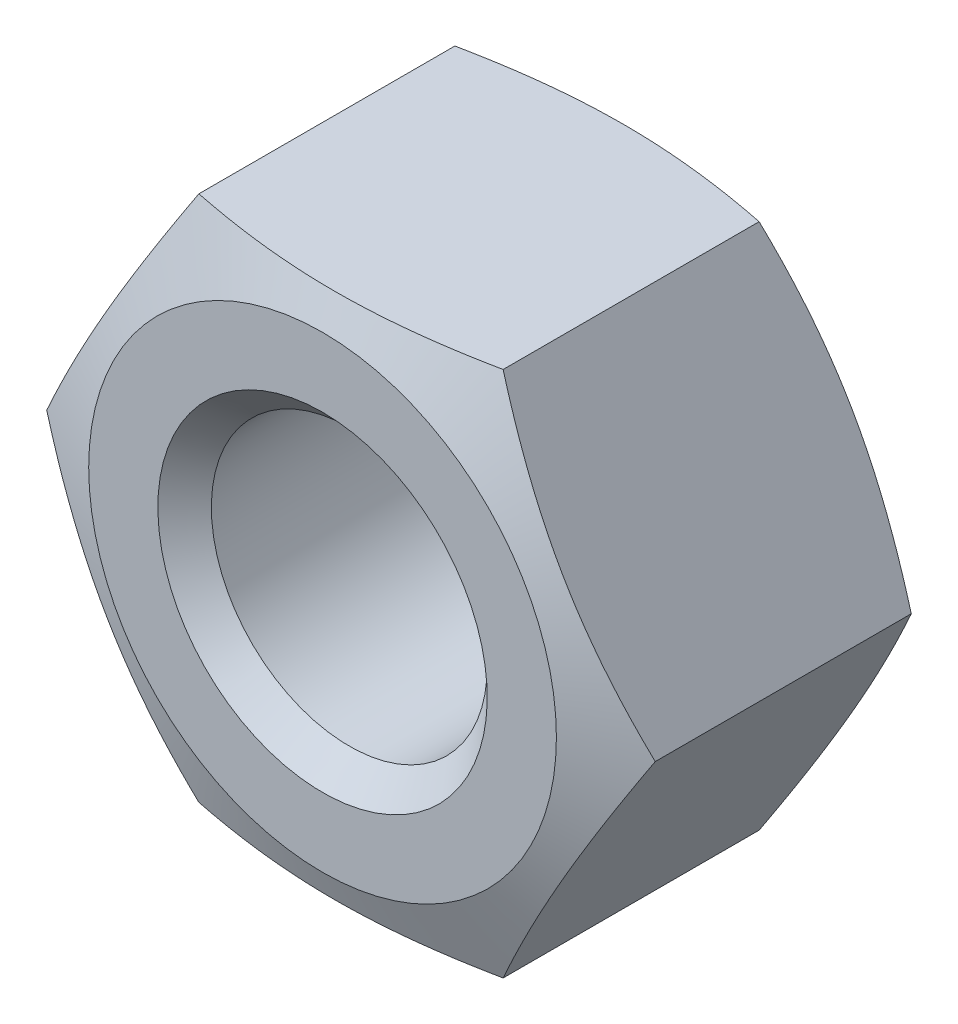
ISO-10303-21;
HEADER;
FILE_DESCRIPTION(('STEP AP214'),'2;1');
FILE_NAME('part.step','',(''),(''),'','','');
FILE_SCHEMA(('AUTOMOTIVE_DESIGN { 1 0 10303 214 1 1 1 1 }'));
ENDSEC;
DATA;
#1=APPLICATION_CONTEXT('core data for automotive mechanical design processes');
#2=APPLICATION_PROTOCOL_DEFINITION('international standard','automotive_design',2000,#1);
#3=PRODUCT_CONTEXT('',#1,'mechanical');
#4=PRODUCT('Part','Part','',(#3));
#5=PRODUCT_RELATED_PRODUCT_CATEGORY('part','',(#4));
#6=PRODUCT_DEFINITION_FORMATION('','',#4);
#7=PRODUCT_DEFINITION_CONTEXT('part definition',#1,'design');
#8=PRODUCT_DEFINITION('design','',#6,#7);
#9=PRODUCT_DEFINITION_SHAPE('','',#8);
#10=(LENGTH_UNIT() NAMED_UNIT(*) SI_UNIT(.MILLI.,.METRE.));
#11=(NAMED_UNIT(*) PLANE_ANGLE_UNIT() SI_UNIT($,.RADIAN.));
#12=(NAMED_UNIT(*) SI_UNIT($,.STERADIAN.) SOLID_ANGLE_UNIT());
#13=UNCERTAINTY_MEASURE_WITH_UNIT(LENGTH_MEASURE(1.E-05),#10,'distance_accuracy_value','');
#14=(GEOMETRIC_REPRESENTATION_CONTEXT(3) GLOBAL_UNCERTAINTY_ASSIGNED_CONTEXT((#13)) GLOBAL_UNIT_ASSIGNED_CONTEXT((#10,
#11,#12)) REPRESENTATION_CONTEXT('',''));
#15=CARTESIAN_POINT('',(0.,0.,0.));
#16=DIRECTION('',(0.,0.,1.));
#17=DIRECTION('',(1.,0.,0.));
#18=AXIS2_PLACEMENT_3D('',#15,#16,#17);
#19=CARTESIAN_POINT('',(9.2376,0.,9.5));
#20=DIRECTION('',(0.,0.,1.));
#21=DIRECTION('',(1.,0.,0.));
#22=AXIS2_PLACEMENT_3D('',#19,#20,#21);
#23=PLANE('',#22);
#24=CARTESIAN_POINT('',(0.,0.,9.5));
#25=DIRECTION('',(0.,0.,-1.));
#26=DIRECTION('',(0.,1.,0.));
#27=AXIS2_PLACEMENT_3D('',#24,#25,#26);
#28=CIRCLE('',#27,5.);
#29=CARTESIAN_POINT('',(0.,5.,9.5));
#30=VERTEX_POINT('',#29);
#31=EDGE_CURVE('E208',#30,#30,#28,.T.);
#32=ORIENTED_EDGE('',*,*,#31,.T.);
#33=EDGE_LOOP('',(#32));
#34=FACE_BOUND('',#33,.T.);
#35=CARTESIAN_POINT('',(0.,0.,9.5));
#36=DIRECTION('',(0.,0.,-1.));
#37=DIRECTION('',(0.,1.,0.));
#38=AXIS2_PLACEMENT_3D('',#35,#36,#37);
#39=CIRCLE('',#38,7.10002499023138);
#40=CARTESIAN_POINT('',(0.,7.10002499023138,9.5));
#41=VERTEX_POINT('',#40);
#42=EDGE_CURVE('E211',#41,#41,#39,.T.);
#43=ORIENTED_EDGE('',*,*,#42,.F.);
#44=EDGE_LOOP('',(#43));
#45=FACE_BOUND('',#44,.T.);
#46=ADVANCED_FACE('F17',(#34,#45),#23,.T.);
#47=CARTESIAN_POINT('',(0.,0.,9.5));
#48=DIRECTION('',(0.,0.,1.));
#49=DIRECTION('',(0.,-1.,0.));
#50=AXIS2_PLACEMENT_3D('',#47,#48,#49);
#51=CONICAL_SURFACE('',#50,5.,0.785398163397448);
#52=CARTESIAN_POINT('',(0.,0.,8.688125));
#53=DIRECTION('',(0.,0.,-1.));
#54=DIRECTION('',(0.,1.,0.));
#55=AXIS2_PLACEMENT_3D('',#52,#53,#54);
#56=CIRCLE('',#55,4.188125);
#57=CARTESIAN_POINT('',(0.,4.188125,8.688125));
#58=VERTEX_POINT('',#57);
#59=EDGE_CURVE('E98',#58,#58,#56,.T.);
#60=ORIENTED_EDGE('',*,*,#59,.T.);
#61=EDGE_LOOP('',(#60));
#62=FACE_BOUND('',#61,.T.);
#63=ORIENTED_EDGE('',*,*,#31,.F.);
#64=EDGE_LOOP('',(#63));
#65=FACE_BOUND('',#64,.T.);
#66=ADVANCED_FACE('F141',(#62,#65),#51,.F.);
#67=CARTESIAN_POINT('',(0.,0.,0.));
#68=DIRECTION('',(0.,0.,-1.));
#69=DIRECTION('',(0.,1.,0.));
#70=AXIS2_PLACEMENT_3D('',#67,#68,#69);
#71=CYLINDRICAL_SURFACE('',#70,4.188125);
#72=CARTESIAN_POINT('',(0.,0.,0.811875));
#73=DIRECTION('',(0.,0.,-1.));
#74=DIRECTION('',(0.,1.,0.));
#75=AXIS2_PLACEMENT_3D('',#72,#73,#74);
#76=CIRCLE('',#75,4.188125);
#77=CARTESIAN_POINT('',(0.,4.188125,0.811875));
#78=VERTEX_POINT('',#77);
#79=EDGE_CURVE('E95',#78,#78,#76,.T.);
#80=ORIENTED_EDGE('',*,*,#79,.T.);
#81=EDGE_LOOP('',(#80));
#82=FACE_BOUND('',#81,.T.);
#83=ORIENTED_EDGE('',*,*,#59,.F.);
#84=EDGE_LOOP('',(#83));
#85=FACE_BOUND('',#84,.T.);
#86=ADVANCED_FACE('F203',(#82,#85),#71,.F.);
#87=CARTESIAN_POINT('',(0.,0.,0.));
#88=DIRECTION('',(0.,0.,-1.));
#89=DIRECTION('',(0.,1.,0.));
#90=AXIS2_PLACEMENT_3D('',#87,#88,#89);
#91=CONICAL_SURFACE('',#90,5.,0.785398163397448);
#92=ORIENTED_EDGE('',*,*,#79,.F.);
#93=EDGE_LOOP('',(#92));
#94=FACE_BOUND('',#93,.T.);
#95=CARTESIAN_POINT('',(0.,0.,0.));
#96=DIRECTION('',(0.,0.,-1.));
#97=DIRECTION('',(0.,1.,0.));
#98=AXIS2_PLACEMENT_3D('',#95,#96,#97);
#99=CIRCLE('',#98,5.);
#100=CARTESIAN_POINT('',(0.,5.,0.));
#101=VERTEX_POINT('',#100);
#102=EDGE_CURVE('E212',#101,#101,#99,.T.);
#103=ORIENTED_EDGE('',*,*,#102,.T.);
#104=EDGE_LOOP('',(#103));
#105=FACE_BOUND('',#104,.T.);
#106=ADVANCED_FACE('F139',(#94,#105),#91,.F.);
#107=CARTESIAN_POINT('',(0.,0.,8.63636363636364));
#108=DIRECTION('',(0.,0.,-1.));
#109=DIRECTION('',(0.,1.,0.));
#110=AXIS2_PLACEMENT_3D('',#107,#108,#109);
#111=CONICAL_SURFACE('',#110,9.2376,1.18682389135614);
#112=ORIENTED_EDGE('',*,*,#42,.T.);
#113=EDGE_LOOP('',(#112));
#114=FACE_BOUND('',#113,.T.);
#115=CARTESIAN_POINT('',(-12.19767328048,-7.99999626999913,6.47502967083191));
#116=CARTESIAN_POINT('',(-11.8369455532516,-7.99999626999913,6.59686503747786));
#117=CARTESIAN_POINT('',(-11.4757372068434,-7.99999626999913,6.7173036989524));
#118=CARTESIAN_POINT('',(-10.7521106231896,-7.99999626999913,6.95460718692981));
#119=CARTESIAN_POINT('',(-10.3896922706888,-7.99999626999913,7.07147166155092));
#120=CARTESIAN_POINT('',(-9.66258724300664,-7.99999626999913,7.30110019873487));
#121=CARTESIAN_POINT('',(-9.29789719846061,-7.99999626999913,7.41385363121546));
#122=CARTESIAN_POINT('',(-8.5668680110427,-7.99999626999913,7.63387021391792));
#123=CARTESIAN_POINT('',(-8.20052890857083,-7.99999626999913,7.74113349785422));
#124=CARTESIAN_POINT('',(-7.4706495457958,-7.99999626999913,7.94744474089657));
#125=CARTESIAN_POINT('',(-7.10713437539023,-7.99999626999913,8.04658101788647));
#126=CARTESIAN_POINT('',(-6.37789114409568,-7.99999626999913,8.23645887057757));
#127=CARTESIAN_POINT('',(-6.01216301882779,-7.99999626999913,8.32720020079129));
#128=CARTESIAN_POINT('',(-5.27844378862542,-7.99999626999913,8.49811523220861));
#129=CARTESIAN_POINT('',(-4.91045408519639,-7.99999626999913,8.5782948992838));
#130=CARTESIAN_POINT('',(-4.17185990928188,-7.99999626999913,8.72560360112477));
#131=CARTESIAN_POINT('',(-3.80125562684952,-7.99999626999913,8.79273357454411));
#132=CARTESIAN_POINT('',(-3.13357726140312,-7.99999626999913,8.89901595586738));
#133=CARTESIAN_POINT('',(-2.83696940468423,-7.99999626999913,8.94108241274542));
#134=CARTESIAN_POINT('',(-2.24234400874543,-7.99999626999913,9.01377227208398));
#135=CARTESIAN_POINT('',(-1.94432650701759,-7.99999626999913,9.04439597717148));
#136=CARTESIAN_POINT('',(-1.34744167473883,-7.99999626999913,9.0929877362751));
#137=CARTESIAN_POINT('',(-1.04857501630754,-7.99999626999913,9.11096394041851));
#138=CARTESIAN_POINT('',(-0.450331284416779,-7.99999626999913,9.13350733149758));
#139=CARTESIAN_POINT('',(-0.15095421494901,-7.99999626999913,9.13807462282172));
#140=CARTESIAN_POINT('',(0.449149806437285,-7.99999626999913,9.13357880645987));
#141=CARTESIAN_POINT('',(0.749876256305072,-7.99999626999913,9.12444942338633));
#142=CARTESIAN_POINT('',(1.35062263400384,-7.99999626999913,9.09285820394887));
#143=CARTESIAN_POINT('',(1.65064255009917,-7.99999626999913,9.07039614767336));
#144=CARTESIAN_POINT('',(2.2496744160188,-7.99999626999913,9.01308145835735));
#145=CARTESIAN_POINT('',(2.54868560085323,-7.99999626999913,8.97822093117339));
#146=CARTESIAN_POINT('',(3.14518812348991,-7.99999626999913,8.89742198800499));
#147=CARTESIAN_POINT('',(3.44267946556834,-7.99999626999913,8.85148360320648));
#148=CARTESIAN_POINT('',(4.08581977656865,-7.99999626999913,8.74145581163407));
#149=CARTESIAN_POINT('',(4.43116695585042,-7.99999626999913,8.67561381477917));
#150=CARTESIAN_POINT('',(5.11962527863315,-7.99999626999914,8.53304691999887));
#151=CARTESIAN_POINT('',(5.46273614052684,-7.99999626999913,8.45632067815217));
#152=CARTESIAN_POINT('',(6.14700710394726,-7.99999626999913,8.29395809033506));
#153=CARTESIAN_POINT('',(6.48816615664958,-7.99999626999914,8.20831735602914));
#154=CARTESIAN_POINT('',(7.16857354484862,-7.99999626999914,8.029846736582));
#155=CARTESIAN_POINT('',(7.50782195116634,-7.99999626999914,7.9370171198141));
#156=CARTESIAN_POINT('',(8.18555195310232,-7.99999626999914,7.74528391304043));
#157=CARTESIAN_POINT('',(8.52402920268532,-7.99999626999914,7.64636502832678));
#158=CARTESIAN_POINT('',(9.19955569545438,-7.99999626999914,7.44377413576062));
#159=CARTESIAN_POINT('',(9.53660492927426,-7.99999626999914,7.34010209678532));
#160=CARTESIAN_POINT('',(10.2093892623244,-7.99999626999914,7.12890845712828));
#161=CARTESIAN_POINT('',(10.5451247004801,-7.99999626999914,7.02138793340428));
#162=CARTESIAN_POINT('',(11.2155576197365,-7.99999626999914,6.80315386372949));
#163=CARTESIAN_POINT('',(11.5502550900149,-7.99999626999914,6.69244028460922));
#164=CARTESIAN_POINT('',(12.5484639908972,-7.99999626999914,6.35788971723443));
#165=CARTESIAN_POINT('',(13.210678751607,-7.99999626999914,6.13018509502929));
#166=CARTESIAN_POINT('',(14.532604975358,-7.99999626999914,5.66750667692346));
#167=CARTESIAN_POINT('',(15.1923162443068,-7.99999626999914,5.43253232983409));
#168=CARTESIAN_POINT('',(16.5054811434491,-7.99999626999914,4.95888361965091));
#169=CARTESIAN_POINT('',(17.1589473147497,-7.99999626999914,4.72024397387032));
#170=CARTESIAN_POINT('',(18.1380301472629,-7.99999626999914,4.35939073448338));
#171=CARTESIAN_POINT('',(18.4641845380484,-7.99999626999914,4.23863171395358));
#172=CARTESIAN_POINT('',(19.1161754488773,-7.99999626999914,3.99626205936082));
#173=CARTESIAN_POINT('',(19.4420119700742,-7.99999626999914,3.87465142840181));
#174=CARTESIAN_POINT('',(19.7677109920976,-7.99999626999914,3.75267343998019));
#175=B_SPLINE_CURVE_WITH_KNOTS('',3,(#115,#116,#117,#118,#119,#120,#121,#122,#123,#124,#125,
#126,#127,#128,#129,#130,#131,#132,#133,#134,#135,#136,#137,#138,#139,#140,#141,#142,#143,#144,
#145,#146,#147,#148,#149,#150,#151,#152,#153,#154,#155,#156,#157,#158,#159,#160,#161,#162,#163,
#164,#165,#166,#167,#168,#169,#170,#171,#172,#173,#174),.UNSPECIFIED.,.F.,.F.,(4,2,2,2,2,2,2,2,
2,2,2,2,2,2,2,2,2,2,2,2,2,2,2,2,2,2,2,2,2,4),(0.,1.14225103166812,2.28461415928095,
3.42974735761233,4.57485265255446,5.70514615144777,6.83547269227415,7.96515799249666,
9.09476200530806,9.99329850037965,10.8918112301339,11.7897444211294,12.6876706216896,
13.5899557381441,14.4922557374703,15.3951312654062,16.298004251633,17.3524879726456,
18.4071020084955,19.4622376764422,20.5173339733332,21.5751980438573,22.6330690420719,
23.6906462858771,24.7482345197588,26.8489740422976,28.9498732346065,31.0368874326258,
32.0802632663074,33.1236352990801),.UNSPECIFIED.);
#176=CARTESIAN_POINT('',(-4.6188,-7.99999626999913,8.63636363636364));
#177=VERTEX_POINT('',#176);
#178=CARTESIAN_POINT('',(4.6188,-7.99999626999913,8.63636363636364));
#179=VERTEX_POINT('',#178);
#180=EDGE_CURVE('E78',#177,#179,#175,.T.);
#181=ORIENTED_EDGE('',*,*,#180,.T.);
#182=CARTESIAN_POINT('',(4.61879988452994,-7.99999646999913,8.63636358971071));
#183=CARTESIAN_POINT('',(4.78016828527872,-7.72049820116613,8.70156440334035));
#184=CARTESIAN_POINT('',(4.94206929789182,-7.44007742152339,8.76185304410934));
#185=CARTESIAN_POINT('',(5.26694187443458,-6.87738161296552,8.87075300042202));
#186=CARTESIAN_POINT('',(5.42991400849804,-6.59510559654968,8.91935747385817));
#187=CARTESIAN_POINT('',(5.75669685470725,-6.02910110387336,9.00294310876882));
#188=CARTESIAN_POINT('',(5.92050730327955,-5.7453730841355,9.03792831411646));
#189=CARTESIAN_POINT('',(6.24873668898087,-5.17686311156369,9.09265414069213));
#190=CARTESIAN_POINT('',(6.4131554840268,-4.89208140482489,9.11239812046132));
#191=CARTESIAN_POINT('',(6.73949003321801,-4.32685338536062,9.13541369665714));
#192=CARTESIAN_POINT('',(6.9014008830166,-4.04641556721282,9.13895930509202));
#193=CARTESIAN_POINT('',(7.22512690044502,-3.48570565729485,9.13013256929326));
#194=CARTESIAN_POINT('',(7.38694205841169,-3.20543358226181,9.11775882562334));
#195=CARTESIAN_POINT('',(7.70998795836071,-2.64590167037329,9.0777585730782));
#196=CARTESIAN_POINT('',(7.87121900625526,-2.36664130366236,9.05014175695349));
#197=CARTESIAN_POINT('',(8.19291130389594,-1.80945389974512,8.9809937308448));
#198=CARTESIAN_POINT('',(8.35337262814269,-1.53152673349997,8.93946389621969));
#199=CARTESIAN_POINT('',(8.57389118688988,-1.14957738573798,8.87381724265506));
#200=CARTESIAN_POINT('',(8.63435021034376,-1.04485928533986,8.85492627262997));
#201=CARTESIAN_POINT('',(8.75512556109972,-0.835670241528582,8.81549930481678));
#202=CARTESIAN_POINT('',(8.81544190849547,-0.73119926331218,8.79496355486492));
#203=CARTESIAN_POINT('',(8.93614338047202,-0.522138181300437,8.75226892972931));
#204=CARTESIAN_POINT('',(8.9965280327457,-0.417548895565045,8.73010473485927));
#205=CARTESIAN_POINT('',(9.11716503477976,-0.20859947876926,8.68430965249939));
#206=CARTESIAN_POINT('',(9.17741736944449,-0.104239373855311,8.66067860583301));
#207=CARTESIAN_POINT('',(9.23760011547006,2.00000000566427E-07,8.63636358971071));
#208=B_SPLINE_CURVE_WITH_KNOTS('',3,(#182,#183,#184,#185,#186,#187,#188,#189,#190,#191,#192,
#193,#194,#195,#196,#197,#198,#199,#200,#201,#202,#203,#204,#205,#206,#207),.UNSPECIFIED.,.F.,
.F.,(4,2,2,2,2,2,2,2,2,2,2,2,4),(0.,0.987840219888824,1.97625750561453,2.96438108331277,
3.95228685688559,4.92341776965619,5.89463405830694,6.86523348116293,7.83573698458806,
8.20288448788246,8.56997677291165,8.93832669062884,9.30671665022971),.UNSPECIFIED.);
#209=CARTESIAN_POINT('',(9.2376,0.,8.63636363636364));
#210=VERTEX_POINT('',#209);
#211=EDGE_CURVE('E163',#179,#210,#208,.T.);
#212=ORIENTED_EDGE('',*,*,#211,.T.);
#213=CARTESIAN_POINT('',(9.23760011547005,-1.99999999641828E-07,8.63636358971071));
#214=CARTESIAN_POINT('',(9.07623171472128,0.279498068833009,8.70156440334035));
#215=CARTESIAN_POINT('',(8.91433070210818,0.559918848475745,8.76185304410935));
#216=CARTESIAN_POINT('',(8.58945812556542,1.12261465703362,8.87075300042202));
#217=CARTESIAN_POINT('',(8.42648599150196,1.40489067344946,8.91935747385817));
#218=CARTESIAN_POINT('',(8.09970314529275,1.97089516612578,9.00294310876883));
#219=CARTESIAN_POINT('',(7.93589269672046,2.25462318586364,9.03792831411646));
#220=CARTESIAN_POINT('',(7.60766331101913,2.82313315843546,9.09265414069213));
#221=CARTESIAN_POINT('',(7.44324451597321,3.10791486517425,9.11239812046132));
#222=CARTESIAN_POINT('',(7.11690996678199,3.67314288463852,9.13541369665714));
#223=CARTESIAN_POINT('',(6.95499911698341,3.95358070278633,9.13895930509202));
#224=CARTESIAN_POINT('',(6.63127309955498,4.51429061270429,9.13013256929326));
#225=CARTESIAN_POINT('',(6.46945794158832,4.79456268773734,9.11775882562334));
#226=CARTESIAN_POINT('',(6.14641204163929,5.35409459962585,9.07775857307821));
#227=CARTESIAN_POINT('',(5.98518099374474,5.63335496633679,9.05014175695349));
#228=CARTESIAN_POINT('',(5.66348869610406,6.19054237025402,8.9809937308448));
#229=CARTESIAN_POINT('',(5.50302737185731,6.46846953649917,8.93946389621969));
#230=CARTESIAN_POINT('',(5.28250881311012,6.85041888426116,8.87381724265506));
#231=CARTESIAN_POINT('',(5.22204978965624,6.95513698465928,8.85492627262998));
#232=CARTESIAN_POINT('',(5.10127443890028,7.16432602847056,8.81549930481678));
#233=CARTESIAN_POINT('',(5.04095809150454,7.26879700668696,8.79496355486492));
#234=CARTESIAN_POINT('',(4.92025661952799,7.4778580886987,8.75226892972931));
#235=CARTESIAN_POINT('',(4.85987196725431,7.58244737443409,8.73010473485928));
#236=CARTESIAN_POINT('',(4.73923496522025,7.79139679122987,8.68430965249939));
#237=CARTESIAN_POINT('',(4.67898263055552,7.89575689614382,8.66067860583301));
#238=CARTESIAN_POINT('',(4.61879988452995,7.99999646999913,8.63636358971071));
#239=B_SPLINE_CURVE_WITH_KNOTS('',3,(#213,#214,#215,#216,#217,#218,#219,#220,#221,#222,#223,
#224,#225,#226,#227,#228,#229,#230,#231,#232,#233,#234,#235,#236,#237,#238),.UNSPECIFIED.,.F.,
.F.,(4,2,2,2,2,2,2,2,2,2,2,2,4),(0.,0.987840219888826,1.97625750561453,2.96438108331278,
3.95228685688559,4.92341776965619,5.89463405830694,6.86523348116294,7.83573698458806,
8.20288448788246,8.56997677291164,8.93832669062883,9.30671665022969),.UNSPECIFIED.);
#240=CARTESIAN_POINT('',(4.6188,7.99999626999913,8.63636363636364));
#241=VERTEX_POINT('',#240);
#242=EDGE_CURVE('E40',#210,#241,#239,.T.);
#243=ORIENTED_EDGE('',*,*,#242,.T.);
#244=CARTESIAN_POINT('',(-12.19767328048,7.99999626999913,6.47502967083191));
#245=CARTESIAN_POINT('',(-11.8369455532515,7.99999626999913,6.59686503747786));
#246=CARTESIAN_POINT('',(-11.4757372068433,7.99999626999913,6.7173036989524));
#247=CARTESIAN_POINT('',(-10.7521106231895,7.99999626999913,6.95460718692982));
#248=CARTESIAN_POINT('',(-10.3896922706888,7.99999626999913,7.07147166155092));
#249=CARTESIAN_POINT('',(-9.66258724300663,7.99999626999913,7.30110019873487));
#250=CARTESIAN_POINT('',(-9.29789719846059,7.99999626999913,7.41385363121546));
#251=CARTESIAN_POINT('',(-8.56686801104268,7.99999626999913,7.63387021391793));
#252=CARTESIAN_POINT('',(-8.20052890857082,7.99999626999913,7.74113349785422));
#253=CARTESIAN_POINT('',(-7.47064954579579,7.99999626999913,7.94744474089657));
#254=CARTESIAN_POINT('',(-7.10713437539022,7.99999626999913,8.04658101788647));
#255=CARTESIAN_POINT('',(-6.37789114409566,7.99999626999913,8.23645887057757));
#256=CARTESIAN_POINT('',(-6.01216301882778,7.99999626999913,8.32720020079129));
#257=CARTESIAN_POINT('',(-5.27844378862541,7.99999626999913,8.49811523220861));
#258=CARTESIAN_POINT('',(-4.91045408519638,7.99999626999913,8.5782948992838));
#259=CARTESIAN_POINT('',(-4.17185990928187,7.99999626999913,8.72560360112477));
#260=CARTESIAN_POINT('',(-3.80125562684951,7.99999626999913,8.79273357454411));
#261=CARTESIAN_POINT('',(-3.13357726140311,7.99999626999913,8.89901595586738));
#262=CARTESIAN_POINT('',(-2.83696940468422,7.99999626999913,8.94108241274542));
#263=CARTESIAN_POINT('',(-2.24234400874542,7.99999626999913,9.01377227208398));
#264=CARTESIAN_POINT('',(-1.94432650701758,7.99999626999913,9.04439597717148));
#265=CARTESIAN_POINT('',(-1.34744167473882,7.99999626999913,9.0929877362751));
#266=CARTESIAN_POINT('',(-1.04857501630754,7.99999626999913,9.11096394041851));
#267=CARTESIAN_POINT('',(-0.450331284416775,7.99999626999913,9.13350733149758));
#268=CARTESIAN_POINT('',(-0.150954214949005,7.99999626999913,9.13807462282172));
#269=CARTESIAN_POINT('',(0.44914980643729,7.99999626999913,9.13357880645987));
#270=CARTESIAN_POINT('',(0.749876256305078,7.99999626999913,9.12444942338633));
#271=CARTESIAN_POINT('',(1.35062263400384,7.99999626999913,9.09285820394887));
#272=CARTESIAN_POINT('',(1.65064255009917,7.99999626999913,9.07039614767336));
#273=CARTESIAN_POINT('',(2.2496744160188,7.99999626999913,9.01308145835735));
#274=CARTESIAN_POINT('',(2.54868560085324,7.99999626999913,8.97822093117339));
#275=CARTESIAN_POINT('',(3.14518812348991,7.99999626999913,8.89742198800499));
#276=CARTESIAN_POINT('',(3.44267946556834,7.99999626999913,8.85148360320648));
#277=CARTESIAN_POINT('',(4.08581977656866,7.99999626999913,8.74145581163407));
#278=CARTESIAN_POINT('',(4.43116695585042,7.99999626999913,8.67561381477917));
#279=CARTESIAN_POINT('',(5.11962527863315,7.99999626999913,8.53304691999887));
#280=CARTESIAN_POINT('',(5.46273614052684,7.99999626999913,8.45632067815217));
#281=CARTESIAN_POINT('',(6.14700710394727,7.99999626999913,8.29395809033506));
#282=CARTESIAN_POINT('',(6.48816615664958,7.99999626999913,8.20831735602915));
#283=CARTESIAN_POINT('',(7.16857354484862,7.99999626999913,8.029846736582));
#284=CARTESIAN_POINT('',(7.50782195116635,7.99999626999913,7.9370171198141));
#285=CARTESIAN_POINT('',(8.18555195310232,7.99999626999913,7.74528391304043));
#286=CARTESIAN_POINT('',(8.52402920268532,7.99999626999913,7.64636502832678));
#287=CARTESIAN_POINT('',(9.19955569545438,7.99999626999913,7.44377413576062));
#288=CARTESIAN_POINT('',(9.53660492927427,7.99999626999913,7.34010209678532));
#289=CARTESIAN_POINT('',(10.2093892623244,7.99999626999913,7.12890845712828));
#290=CARTESIAN_POINT('',(10.5451247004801,7.99999626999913,7.02138793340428));
#291=CARTESIAN_POINT('',(11.2155576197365,7.99999626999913,6.80315386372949));
#292=CARTESIAN_POINT('',(11.5502550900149,7.99999626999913,6.69244028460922));
#293=CARTESIAN_POINT('',(12.5484639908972,7.99999626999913,6.35788971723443));
#294=CARTESIAN_POINT('',(13.210678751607,7.99999626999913,6.13018509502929));
#295=CARTESIAN_POINT('',(14.532604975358,7.99999626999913,5.66750667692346));
#296=CARTESIAN_POINT('',(15.1923162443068,7.99999626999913,5.43253232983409));
#297=CARTESIAN_POINT('',(16.5054811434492,7.99999626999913,4.95888361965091));
#298=CARTESIAN_POINT('',(17.1589473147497,7.99999626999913,4.72024397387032));
#299=CARTESIAN_POINT('',(18.1380301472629,7.99999626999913,4.35939073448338));
#300=CARTESIAN_POINT('',(18.4641845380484,7.99999626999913,4.23863171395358));
#301=CARTESIAN_POINT('',(19.1161754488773,7.99999626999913,3.99626205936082));
#302=CARTESIAN_POINT('',(19.4420119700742,7.99999626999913,3.87465142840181));
#303=CARTESIAN_POINT('',(19.7677109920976,7.99999626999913,3.75267343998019));
#304=B_SPLINE_CURVE_WITH_KNOTS('',3,(#244,#245,#246,#247,#248,#249,#250,#251,#252,#253,#254,
#255,#256,#257,#258,#259,#260,#261,#262,#263,#264,#265,#266,#267,#268,#269,#270,#271,#272,#273,
#274,#275,#276,#277,#278,#279,#280,#281,#282,#283,#284,#285,#286,#287,#288,#289,#290,#291,#292,
#293,#294,#295,#296,#297,#298,#299,#300,#301,#302,#303),.UNSPECIFIED.,.F.,.F.,(4,2,2,2,2,2,2,2,
2,2,2,2,2,2,2,2,2,2,2,2,2,2,2,2,2,2,2,2,2,4),(0.,1.14225103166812,2.28461415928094,
3.42974735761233,4.57485265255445,5.70514615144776,6.83547269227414,7.96515799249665,
9.09476200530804,9.99329850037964,10.8918112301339,11.7897444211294,12.6876706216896,
13.5899557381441,14.4922557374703,15.3951312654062,16.298004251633,17.3524879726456,
18.4071020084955,19.4622376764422,20.5173339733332,21.5751980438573,22.6330690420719,
23.6906462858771,24.7482345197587,26.8489740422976,28.9498732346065,31.0368874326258,
32.0802632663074,33.1236352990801),.UNSPECIFIED.);
#305=CARTESIAN_POINT('',(-4.6188,7.99999626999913,8.63636363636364));
#306=VERTEX_POINT('',#305);
#307=EDGE_CURVE('E154',#241,#306,#304,.F.);
#308=ORIENTED_EDGE('',*,*,#307,.T.);
#309=CARTESIAN_POINT('',(-4.61879988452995,7.99999646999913,8.63636358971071));
#310=CARTESIAN_POINT('',(-4.78016828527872,7.72049820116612,8.70156440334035));
#311=CARTESIAN_POINT('',(-4.94206929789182,7.44007742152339,8.76185304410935));
#312=CARTESIAN_POINT('',(-5.26694187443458,6.87738161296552,8.87075300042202));
#313=CARTESIAN_POINT('',(-5.42991400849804,6.59510559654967,8.91935747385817));
#314=CARTESIAN_POINT('',(-5.75669685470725,6.02910110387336,9.00294310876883));
#315=CARTESIAN_POINT('',(-5.92050730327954,5.74537308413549,9.03792831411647));
#316=CARTESIAN_POINT('',(-6.24873668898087,5.17686311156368,9.09265414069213));
#317=CARTESIAN_POINT('',(-6.41315548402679,4.89208140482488,9.11239812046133));
#318=CARTESIAN_POINT('',(-6.739490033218,4.32685338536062,9.13541369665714));
#319=CARTESIAN_POINT('',(-6.90140088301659,4.04641556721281,9.13895930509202));
#320=CARTESIAN_POINT('',(-7.22512690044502,3.48570565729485,9.13013256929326));
#321=CARTESIAN_POINT('',(-7.38694205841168,3.2054335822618,9.11775882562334));
#322=CARTESIAN_POINT('',(-7.7099879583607,2.64590167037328,9.07775857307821));
#323=CARTESIAN_POINT('',(-7.87121900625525,2.36664130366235,9.0501417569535));
#324=CARTESIAN_POINT('',(-8.19291130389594,1.80945389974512,8.9809937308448));
#325=CARTESIAN_POINT('',(-8.35337262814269,1.53152673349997,8.93946389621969));
#326=CARTESIAN_POINT('',(-8.57389118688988,1.14957738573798,8.87381724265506));
#327=CARTESIAN_POINT('',(-8.63435021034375,1.04485928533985,8.85492627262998));
#328=CARTESIAN_POINT('',(-8.75512556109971,0.835670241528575,8.81549930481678));
#329=CARTESIAN_POINT('',(-8.81544190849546,0.731199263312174,8.79496355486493));
#330=CARTESIAN_POINT('',(-8.93614338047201,0.522138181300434,8.75226892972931));
#331=CARTESIAN_POINT('',(-8.99652803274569,0.417548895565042,8.73010473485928));
#332=CARTESIAN_POINT('',(-9.11716503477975,0.208599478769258,8.68430965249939));
#333=CARTESIAN_POINT('',(-9.17741736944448,0.104239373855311,8.66067860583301));
#334=CARTESIAN_POINT('',(-9.23760011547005,-1.99999998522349E-07,8.63636358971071));
#335=B_SPLINE_CURVE_WITH_KNOTS('',3,(#309,#310,#311,#312,#313,#314,#315,#316,#317,#318,#319,
#320,#321,#322,#323,#324,#325,#326,#327,#328,#329,#330,#331,#332,#333,#334),.UNSPECIFIED.,.F.,
.F.,(4,2,2,2,2,2,2,2,2,2,2,2,4),(0.,0.987840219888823,1.97625750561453,2.96438108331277,
3.95228685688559,4.92341776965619,5.89463405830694,6.86523348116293,7.83573698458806,
8.20288448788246,8.56997677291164,8.93832669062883,9.3067166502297),.UNSPECIFIED.);
#336=CARTESIAN_POINT('',(-9.2376,0.,8.63636363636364));
#337=VERTEX_POINT('',#336);
#338=EDGE_CURVE('E149',#306,#337,#335,.T.);
#339=ORIENTED_EDGE('',*,*,#338,.T.);
#340=CARTESIAN_POINT('',(-9.23760011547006,2.00000001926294E-07,8.63636358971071));
#341=CARTESIAN_POINT('',(-9.07623171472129,-0.279498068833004,8.70156440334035));
#342=CARTESIAN_POINT('',(-8.91433070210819,-0.559918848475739,8.76185304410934));
#343=CARTESIAN_POINT('',(-8.58945812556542,-1.12261465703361,8.87075300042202));
#344=CARTESIAN_POINT('',(-8.42648599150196,-1.40489067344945,8.91935747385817));
#345=CARTESIAN_POINT('',(-8.09970314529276,-1.97089516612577,9.00294310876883));
#346=CARTESIAN_POINT('',(-7.93589269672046,-2.25462318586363,9.03792831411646));
#347=CARTESIAN_POINT('',(-7.60766331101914,-2.82313315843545,9.09265414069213));
#348=CARTESIAN_POINT('',(-7.44324451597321,-3.10791486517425,9.11239812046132));
#349=CARTESIAN_POINT('',(-7.116909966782,-3.67314288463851,9.13541369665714));
#350=CARTESIAN_POINT('',(-6.95499911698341,-3.95358070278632,9.13895930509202));
#351=CARTESIAN_POINT('',(-6.63127309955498,-4.51429061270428,9.13013256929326));
#352=CARTESIAN_POINT('',(-6.46945794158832,-4.79456268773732,9.11775882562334));
#353=CARTESIAN_POINT('',(-6.1464120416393,-5.35409459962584,9.07775857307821));
#354=CARTESIAN_POINT('',(-5.98518099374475,-5.63335496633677,9.0501417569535));
#355=CARTESIAN_POINT('',(-5.66348869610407,-6.19054237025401,8.9809937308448));
#356=CARTESIAN_POINT('',(-5.50302737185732,-6.46846953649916,8.93946389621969));
#357=CARTESIAN_POINT('',(-5.28250881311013,-6.85041888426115,8.87381724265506));
#358=CARTESIAN_POINT('',(-5.22204978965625,-6.95513698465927,8.85492627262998));
#359=CARTESIAN_POINT('',(-5.10127443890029,-7.16432602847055,8.81549930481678));
#360=CARTESIAN_POINT('',(-5.04095809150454,-7.26879700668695,8.79496355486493));
#361=CARTESIAN_POINT('',(-4.92025661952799,-7.47785808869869,8.75226892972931));
#362=CARTESIAN_POINT('',(-4.85987196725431,-7.58244737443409,8.73010473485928));
#363=CARTESIAN_POINT('',(-4.73923496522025,-7.79139679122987,8.68430965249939));
#364=CARTESIAN_POINT('',(-4.67898263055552,-7.89575689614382,8.66067860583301));
#365=CARTESIAN_POINT('',(-4.61879988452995,-7.99999646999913,8.63636358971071));
#366=B_SPLINE_CURVE_WITH_KNOTS('',3,(#340,#341,#342,#343,#344,#345,#346,#347,#348,#349,#350,
#351,#352,#353,#354,#355,#356,#357,#358,#359,#360,#361,#362,#363,#364,#365),.UNSPECIFIED.,.F.,
.F.,(4,2,2,2,2,2,2,2,2,2,2,2,4),(0.,0.987840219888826,1.97625750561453,2.96438108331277,
3.95228685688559,4.92341776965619,5.89463405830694,6.86523348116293,7.83573698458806,
8.20288448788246,8.56997677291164,8.93832669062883,9.3067166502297),.UNSPECIFIED.);
#367=EDGE_CURVE('E126',#337,#177,#366,.T.);
#368=ORIENTED_EDGE('',*,*,#367,.T.);
#369=EDGE_LOOP('',(#181,#212,#243,#308,#339,#368));
#370=FACE_BOUND('',#369,.T.);
#371=ADVANCED_FACE('F135',(#114,#370),#111,.T.);
#372=CARTESIAN_POINT('',(4.6188,-7.99999626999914,9.5));
#373=DIRECTION('',(-0.866025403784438,0.5,0.));
#374=DIRECTION('',(-0.5,-0.866025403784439,0.));
#375=AXIS2_PLACEMENT_3D('',#372,#373,#374);
#376=PLANE('',#375);
#377=ORIENTED_EDGE('',*,*,#211,.F.);
#378=DIRECTION('',(0.,0.,-1.));
#379=VECTOR('',#378,1.);
#380=CARTESIAN_POINT('',(4.6188,-7.99999626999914,9.5));
#381=LINE('',#380,#379);
#382=CARTESIAN_POINT('',(4.6188,-7.99999626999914,0.863636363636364));
#383=VERTEX_POINT('',#382);
#384=EDGE_CURVE('E82',#179,#383,#381,.T.);
#385=ORIENTED_EDGE('',*,*,#384,.T.);
#386=CARTESIAN_POINT('',(9.23760011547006,2.00000000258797E-07,0.863636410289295));
#387=CARTESIAN_POINT('',(9.07623171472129,-0.279498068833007,0.798435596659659));
#388=CARTESIAN_POINT('',(8.91433070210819,-0.559918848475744,0.738146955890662));
#389=CARTESIAN_POINT('',(8.58945812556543,-1.12261465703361,0.629246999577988));
#390=CARTESIAN_POINT('',(8.42648599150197,-1.40489067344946,0.580642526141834));
#391=CARTESIAN_POINT('',(8.09970314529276,-1.97089516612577,0.497056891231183));
#392=CARTESIAN_POINT('',(7.93589269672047,-2.25462318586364,0.462071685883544));
#393=CARTESIAN_POINT('',(7.60766331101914,-2.82313315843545,0.407345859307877));
#394=CARTESIAN_POINT('',(7.44324451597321,-3.10791486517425,0.387601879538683));
#395=CARTESIAN_POINT('',(7.116909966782,-3.67314288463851,0.364586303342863));
#396=CARTESIAN_POINT('',(6.95499911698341,-3.95358070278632,0.361040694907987));
#397=CARTESIAN_POINT('',(6.63127309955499,-4.51429061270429,0.369867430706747));
#398=CARTESIAN_POINT('',(6.46945794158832,-4.79456268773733,0.382241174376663));
#399=CARTESIAN_POINT('',(6.1464120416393,-5.35409459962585,0.422241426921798));
#400=CARTESIAN_POINT('',(5.98518099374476,-5.63335496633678,0.44985824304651));
#401=CARTESIAN_POINT('',(5.66348869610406,-6.19054237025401,0.519006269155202));
#402=CARTESIAN_POINT('',(5.5030273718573,-6.46846953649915,0.560536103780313));
#403=CARTESIAN_POINT('',(5.28250881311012,-6.85041888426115,0.626182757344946));
#404=CARTESIAN_POINT('',(5.22204978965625,-6.95513698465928,0.645073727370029));
#405=CARTESIAN_POINT('',(5.10127443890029,-7.16432602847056,0.684500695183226));
#406=CARTESIAN_POINT('',(5.04095809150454,-7.26879700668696,0.705036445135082));
#407=CARTESIAN_POINT('',(4.92025661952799,-7.4778580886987,0.747731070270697));
#408=CARTESIAN_POINT('',(4.85987196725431,-7.5824473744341,0.769895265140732));
#409=CARTESIAN_POINT('',(4.73923496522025,-7.79139679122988,0.815690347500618));
#410=CARTESIAN_POINT('',(4.67898263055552,-7.89575689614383,0.839321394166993));
#411=CARTESIAN_POINT('',(4.61879988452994,-7.99999646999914,0.863636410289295));
#412=B_SPLINE_CURVE_WITH_KNOTS('',3,(#386,#387,#388,#389,#390,#391,#392,#393,#394,#395,#396,
#397,#398,#399,#400,#401,#402,#403,#404,#405,#406,#407,#408,#409,#410,#411),.UNSPECIFIED.,.F.,
.F.,(4,2,2,2,2,2,2,2,2,2,2,2,4),(0.,0.987840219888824,1.97625750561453,2.96438108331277,
3.95228685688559,4.92341776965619,5.89463405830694,6.86523348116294,7.83573698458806,
8.20288448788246,8.56997677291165,8.93832669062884,9.30671665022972),.UNSPECIFIED.);
#413=CARTESIAN_POINT('',(9.2376,0.,0.863636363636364));
#414=VERTEX_POINT('',#413);
#415=EDGE_CURVE('E33',#414,#383,#412,.T.);
#416=ORIENTED_EDGE('',*,*,#415,.F.);
#417=DIRECTION('',(0.,0.,-1.));
#418=VECTOR('',#417,1.);
#419=CARTESIAN_POINT('',(9.2376,0.,9.5));
#420=LINE('',#419,#418);
#421=EDGE_CURVE('E26',#210,#414,#420,.T.);
#422=ORIENTED_EDGE('',*,*,#421,.F.);
#423=EDGE_LOOP('',(#377,#385,#416,#422));
#424=FACE_BOUND('',#423,.T.);
#425=ADVANCED_FACE('F19',(#424),#376,.F.);
#426=CARTESIAN_POINT('',(9.2376,0.,9.5));
#427=DIRECTION('',(-0.866025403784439,-0.5,0.));
#428=DIRECTION('',(0.5,-0.866025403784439,0.));
#429=AXIS2_PLACEMENT_3D('',#426,#427,#428);
#430=PLANE('',#429);
#431=ORIENTED_EDGE('',*,*,#242,.F.);
#432=ORIENTED_EDGE('',*,*,#421,.T.);
#433=CARTESIAN_POINT('',(4.61879988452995,7.99999646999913,0.863636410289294));
#434=CARTESIAN_POINT('',(4.78016828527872,7.72049820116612,0.798435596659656));
#435=CARTESIAN_POINT('',(4.94206929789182,7.44007742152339,0.738146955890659));
#436=CARTESIAN_POINT('',(5.26694187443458,6.87738161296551,0.629246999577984));
#437=CARTESIAN_POINT('',(5.42991400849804,6.59510559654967,0.58064252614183));
#438=CARTESIAN_POINT('',(5.75669685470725,6.02910110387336,0.497056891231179));
#439=CARTESIAN_POINT('',(5.92050730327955,5.74537308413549,0.46207168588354));
#440=CARTESIAN_POINT('',(6.24873668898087,5.17686311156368,0.407345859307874));
#441=CARTESIAN_POINT('',(6.41315548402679,4.89208140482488,0.38760187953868));
#442=CARTESIAN_POINT('',(6.739490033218,4.32685338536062,0.364586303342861));
#443=CARTESIAN_POINT('',(6.90140088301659,4.04641556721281,0.361040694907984));
#444=CARTESIAN_POINT('',(7.22512690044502,3.48570565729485,0.369867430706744));
#445=CARTESIAN_POINT('',(7.38694205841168,3.2054335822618,0.382241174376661));
#446=CARTESIAN_POINT('',(7.7099879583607,2.64590167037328,0.422241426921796));
#447=CARTESIAN_POINT('',(7.87121900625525,2.36664130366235,0.449858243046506));
#448=CARTESIAN_POINT('',(8.19291130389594,1.80945389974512,0.519006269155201));
#449=CARTESIAN_POINT('',(8.35337262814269,1.53152673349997,0.560536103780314));
#450=CARTESIAN_POINT('',(8.57389118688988,1.14957738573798,0.626182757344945));
#451=CARTESIAN_POINT('',(8.63435021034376,1.04485928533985,0.645073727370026));
#452=CARTESIAN_POINT('',(8.75512556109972,0.835670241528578,0.684500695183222));
#453=CARTESIAN_POINT('',(8.81544190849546,0.731199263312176,0.705036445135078));
#454=CARTESIAN_POINT('',(8.93614338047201,0.522138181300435,0.747731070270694));
#455=CARTESIAN_POINT('',(8.99652803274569,0.417548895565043,0.769895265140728));
#456=CARTESIAN_POINT('',(9.11716503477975,0.208599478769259,0.815690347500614));
#457=CARTESIAN_POINT('',(9.17741736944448,0.104239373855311,0.839321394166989));
#458=CARTESIAN_POINT('',(9.23760011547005,-1.99999999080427E-07,0.863636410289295));
#459=B_SPLINE_CURVE_WITH_KNOTS('',3,(#433,#434,#435,#436,#437,#438,#439,#440,#441,#442,#443,
#444,#445,#446,#447,#448,#449,#450,#451,#452,#453,#454,#455,#456,#457,#458),.UNSPECIFIED.,.F.,
.F.,(4,2,2,2,2,2,2,2,2,2,2,2,4),(0.,0.987840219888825,1.97625750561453,2.96438108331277,
3.95228685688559,4.92341776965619,5.89463405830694,6.86523348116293,7.83573698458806,
8.20288448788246,8.56997677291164,8.93832669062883,9.3067166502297),.UNSPECIFIED.);
#460=CARTESIAN_POINT('',(4.6188,7.99999626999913,0.863636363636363));
#461=VERTEX_POINT('',#460);
#462=EDGE_CURVE('E174',#461,#414,#459,.T.);
#463=ORIENTED_EDGE('',*,*,#462,.F.);
#464=DIRECTION('',(0.,0.,-1.));
#465=VECTOR('',#464,1.);
#466=CARTESIAN_POINT('',(4.6188,7.99999626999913,9.5));
#467=LINE('',#466,#465);
#468=EDGE_CURVE('E301',#241,#461,#467,.T.);
#469=ORIENTED_EDGE('',*,*,#468,.F.);
#470=EDGE_LOOP('',(#431,#432,#463,#469));
#471=FACE_BOUND('',#470,.T.);
#472=ADVANCED_FACE('F168',(#471),#430,.F.);
#473=CARTESIAN_POINT('',(4.6188,7.99999626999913,9.5));
#474=DIRECTION('',(0.,-1.,0.));
#475=DIRECTION('',(1.,0.,0.));
#476=AXIS2_PLACEMENT_3D('',#473,#474,#475);
#477=PLANE('',#476);
#478=ORIENTED_EDGE('',*,*,#307,.F.);
#479=ORIENTED_EDGE('',*,*,#468,.T.);
#480=CARTESIAN_POINT('',(-12.19767328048,7.99999626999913,3.0249703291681));
#481=CARTESIAN_POINT('',(-11.8369455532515,7.99999626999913,2.90313496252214));
#482=CARTESIAN_POINT('',(-11.4757372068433,7.99999626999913,2.7826963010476));
#483=CARTESIAN_POINT('',(-10.7521106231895,7.99999626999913,2.54539281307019));
#484=CARTESIAN_POINT('',(-10.3896922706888,7.99999626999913,2.42852833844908));
#485=CARTESIAN_POINT('',(-9.66258724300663,7.99999626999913,2.19889980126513));
#486=CARTESIAN_POINT('',(-9.2978971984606,7.99999626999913,2.08614636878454));
#487=CARTESIAN_POINT('',(-8.56686801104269,7.99999626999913,1.86612978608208));
#488=CARTESIAN_POINT('',(-8.20052890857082,7.99999626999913,1.75886650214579));
#489=CARTESIAN_POINT('',(-7.47064954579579,7.99999626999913,1.55255525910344));
#490=CARTESIAN_POINT('',(-7.10713437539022,7.99999626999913,1.45341898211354));
#491=CARTESIAN_POINT('',(-6.37789114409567,7.99999626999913,1.26354112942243));
#492=CARTESIAN_POINT('',(-6.01216301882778,7.99999626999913,1.17279979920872));
#493=CARTESIAN_POINT('',(-5.27844378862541,7.99999626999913,1.00188476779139));
#494=CARTESIAN_POINT('',(-4.91045408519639,7.99999626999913,0.921705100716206));
#495=CARTESIAN_POINT('',(-4.17185990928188,7.99999626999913,0.774396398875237));
#496=CARTESIAN_POINT('',(-3.80125562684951,7.99999626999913,0.707266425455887));
#497=CARTESIAN_POINT('',(-3.13357726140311,7.99999626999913,0.600984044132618));
#498=CARTESIAN_POINT('',(-2.83696940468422,7.99999626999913,0.558917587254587));
#499=CARTESIAN_POINT('',(-2.24234400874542,7.99999626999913,0.486227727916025));
#500=CARTESIAN_POINT('',(-1.94432650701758,7.99999626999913,0.455604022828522));
#501=CARTESIAN_POINT('',(-1.34744167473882,7.99999626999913,0.407012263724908));
#502=CARTESIAN_POINT('',(-1.04857501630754,7.99999626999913,0.389036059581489));
#503=CARTESIAN_POINT('',(-0.450331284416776,7.99999626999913,0.366492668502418));
#504=CARTESIAN_POINT('',(-0.150954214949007,7.99999626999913,0.36192537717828));
#505=CARTESIAN_POINT('',(0.449149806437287,7.99999626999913,0.366421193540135));
#506=CARTESIAN_POINT('',(0.749876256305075,7.99999626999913,0.37555057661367));
#507=CARTESIAN_POINT('',(1.35062263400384,7.99999626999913,0.407141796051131));
#508=CARTESIAN_POINT('',(1.65064255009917,7.99999626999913,0.429603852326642));
#509=CARTESIAN_POINT('',(2.2496744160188,7.99999626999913,0.486918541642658));
#510=CARTESIAN_POINT('',(2.54868560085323,7.99999626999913,0.52177906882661));
#511=CARTESIAN_POINT('',(3.14518812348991,7.99999626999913,0.602578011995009));
#512=CARTESIAN_POINT('',(3.44267946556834,7.99999626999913,0.648516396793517));
#513=CARTESIAN_POINT('',(4.08581977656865,7.99999626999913,0.758544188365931));
#514=CARTESIAN_POINT('',(4.43116695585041,7.99999626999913,0.824386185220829));
#515=CARTESIAN_POINT('',(5.11962527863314,7.99999626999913,0.966953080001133));
#516=CARTESIAN_POINT('',(5.46273614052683,7.99999626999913,1.04367932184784));
#517=CARTESIAN_POINT('',(6.14700710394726,7.99999626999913,1.20604190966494));
#518=CARTESIAN_POINT('',(6.48816615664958,7.99999626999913,1.29168264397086));
#519=CARTESIAN_POINT('',(7.16857354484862,7.99999626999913,1.470153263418));
#520=CARTESIAN_POINT('',(7.50782195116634,7.99999626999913,1.5629828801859));
#521=CARTESIAN_POINT('',(8.18555195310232,7.99999626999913,1.75471608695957));
#522=CARTESIAN_POINT('',(8.52402920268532,7.99999626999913,1.85363497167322));
#523=CARTESIAN_POINT('',(9.19955569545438,7.99999626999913,2.05622586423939));
#524=CARTESIAN_POINT('',(9.53660492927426,7.99999626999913,2.15989790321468));
#525=CARTESIAN_POINT('',(10.2093892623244,7.99999626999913,2.37109154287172));
#526=CARTESIAN_POINT('',(10.5451247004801,7.99999626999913,2.47861206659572));
#527=CARTESIAN_POINT('',(11.2155576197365,7.99999626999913,2.69684613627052));
#528=CARTESIAN_POINT('',(11.5502550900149,7.99999626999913,2.80755971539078));
#529=CARTESIAN_POINT('',(12.5484639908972,7.99999626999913,3.14211028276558));
#530=CARTESIAN_POINT('',(13.210678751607,7.99999626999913,3.36981490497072));
#531=CARTESIAN_POINT('',(14.532604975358,7.99999626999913,3.83249332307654));
#532=CARTESIAN_POINT('',(15.1923162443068,7.99999626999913,4.06746767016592));
#533=CARTESIAN_POINT('',(16.5054811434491,7.99999626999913,4.54111638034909));
#534=CARTESIAN_POINT('',(17.1589473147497,7.99999626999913,4.77975602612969));
#535=CARTESIAN_POINT('',(18.1380301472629,7.99999626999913,5.14060926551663));
#536=CARTESIAN_POINT('',(18.4641845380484,7.99999626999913,5.26136828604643));
#537=CARTESIAN_POINT('',(19.1161754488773,7.99999626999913,5.50373794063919));
#538=CARTESIAN_POINT('',(19.4420119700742,7.99999626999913,5.6253485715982));
#539=CARTESIAN_POINT('',(19.7677109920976,7.99999626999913,5.74732656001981));
#540=B_SPLINE_CURVE_WITH_KNOTS('',3,(#480,#481,#482,#483,#484,#485,#486,#487,#488,#489,#490,
#491,#492,#493,#494,#495,#496,#497,#498,#499,#500,#501,#502,#503,#504,#505,#506,#507,#508,#509,
#510,#511,#512,#513,#514,#515,#516,#517,#518,#519,#520,#521,#522,#523,#524,#525,#526,#527,#528,
#529,#530,#531,#532,#533,#534,#535,#536,#537,#538,#539),.UNSPECIFIED.,.F.,.F.,(4,2,2,2,2,2,2,2,
2,2,2,2,2,2,2,2,2,2,2,2,2,2,2,2,2,2,2,2,2,4),(0.,1.14225103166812,2.28461415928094,
3.42974735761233,4.57485265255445,5.70514615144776,6.83547269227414,7.96515799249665,
9.09476200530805,9.99329850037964,10.8918112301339,11.7897444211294,12.6876706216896,
13.5899557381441,14.4922557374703,15.3951312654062,16.298004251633,17.3524879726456,
18.4071020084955,19.4622376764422,20.5173339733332,21.5751980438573,22.6330690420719,
23.6906462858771,24.7482345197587,26.8489740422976,28.9498732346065,31.0368874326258,
32.0802632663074,33.1236352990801),.UNSPECIFIED.);
#541=CARTESIAN_POINT('',(-4.6188,7.99999626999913,0.863636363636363));
#542=VERTEX_POINT('',#541);
#543=EDGE_CURVE('E179',#542,#461,#540,.T.);
#544=ORIENTED_EDGE('',*,*,#543,.F.);
#545=DIRECTION('',(0.,0.,-1.));
#546=VECTOR('',#545,1.);
#547=CARTESIAN_POINT('',(-4.6188,7.99999626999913,9.5));
#548=LINE('',#547,#546);
#549=EDGE_CURVE('E303',#306,#542,#548,.T.);
#550=ORIENTED_EDGE('',*,*,#549,.F.);
#551=EDGE_LOOP('',(#478,#479,#544,#550));
#552=FACE_BOUND('',#551,.T.);
#553=ADVANCED_FACE('F171',(#552),#477,.F.);
#554=CARTESIAN_POINT('',(-4.6188,7.99999626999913,9.5));
#555=DIRECTION('',(0.866025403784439,-0.5,0.));
#556=DIRECTION('',(0.5,0.866025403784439,0.));
#557=AXIS2_PLACEMENT_3D('',#554,#555,#556);
#558=PLANE('',#557);
#559=ORIENTED_EDGE('',*,*,#338,.F.);
#560=ORIENTED_EDGE('',*,*,#549,.T.);
#561=CARTESIAN_POINT('',(-9.23760011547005,-1.99999998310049E-07,0.863636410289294));
#562=CARTESIAN_POINT('',(-9.07623171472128,0.279498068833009,0.798435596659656));
#563=CARTESIAN_POINT('',(-8.91433070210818,0.559918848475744,0.738146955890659));
#564=CARTESIAN_POINT('',(-8.58945812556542,1.12261465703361,0.629246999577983));
#565=CARTESIAN_POINT('',(-8.42648599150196,1.40489067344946,0.580642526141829));
#566=CARTESIAN_POINT('',(-8.09970314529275,1.97089516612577,0.497056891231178));
#567=CARTESIAN_POINT('',(-7.93589269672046,2.25462318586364,0.46207168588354));
#568=CARTESIAN_POINT('',(-7.60766331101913,2.82313315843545,0.407345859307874));
#569=CARTESIAN_POINT('',(-7.44324451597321,3.10791486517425,0.387601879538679));
#570=CARTESIAN_POINT('',(-7.116909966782,3.67314288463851,0.36458630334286));
#571=CARTESIAN_POINT('',(-6.95499911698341,3.95358070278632,0.361040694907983));
#572=CARTESIAN_POINT('',(-6.63127309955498,4.51429061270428,0.369867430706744));
#573=CARTESIAN_POINT('',(-6.46945794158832,4.79456268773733,0.38224117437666));
#574=CARTESIAN_POINT('',(-6.1464120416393,5.35409459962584,0.422241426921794));
#575=CARTESIAN_POINT('',(-5.98518099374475,5.63335496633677,0.449858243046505));
#576=CARTESIAN_POINT('',(-5.66348869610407,6.19054237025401,0.5190062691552));
#577=CARTESIAN_POINT('',(-5.50302737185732,6.46846953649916,0.560536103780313));
#578=CARTESIAN_POINT('',(-5.28250881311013,6.85041888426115,0.626182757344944));
#579=CARTESIAN_POINT('',(-5.22204978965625,6.95513698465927,0.645073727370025));
#580=CARTESIAN_POINT('',(-5.10127443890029,7.16432602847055,0.684500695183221));
#581=CARTESIAN_POINT('',(-5.04095809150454,7.26879700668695,0.705036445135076));
#582=CARTESIAN_POINT('',(-4.92025661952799,7.47785808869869,0.747731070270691));
#583=CARTESIAN_POINT('',(-4.85987196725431,7.58244737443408,0.769895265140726));
#584=CARTESIAN_POINT('',(-4.73923496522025,7.79139679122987,0.815690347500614));
#585=CARTESIAN_POINT('',(-4.67898263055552,7.89575689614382,0.839321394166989));
#586=CARTESIAN_POINT('',(-4.61879988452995,7.99999646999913,0.863636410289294));
#587=B_SPLINE_CURVE_WITH_KNOTS('',3,(#561,#562,#563,#564,#565,#566,#567,#568,#569,#570,#571,
#572,#573,#574,#575,#576,#577,#578,#579,#580,#581,#582,#583,#584,#585,#586),.UNSPECIFIED.,.F.,
.F.,(4,2,2,2,2,2,2,2,2,2,2,2,4),(0.,0.987840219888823,1.97625750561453,2.96438108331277,
3.95228685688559,4.92341776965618,5.89463405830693,6.86523348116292,7.83573698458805,
8.20288448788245,8.56997677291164,8.93832669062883,9.3067166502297),.UNSPECIFIED.);
#588=CARTESIAN_POINT('',(-9.2376,0.,0.863636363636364));
#589=VERTEX_POINT('',#588);
#590=EDGE_CURVE('E91',#589,#542,#587,.T.);
#591=ORIENTED_EDGE('',*,*,#590,.F.);
#592=DIRECTION('',(0.,0.,-1.));
#593=VECTOR('',#592,1.);
#594=CARTESIAN_POINT('',(-9.2376,0.,9.5));
#595=LINE('',#594,#593);
#596=EDGE_CURVE('E81',#337,#589,#595,.T.);
#597=ORIENTED_EDGE('',*,*,#596,.F.);
#598=EDGE_LOOP('',(#559,#560,#591,#597));
#599=FACE_BOUND('',#598,.T.);
#600=ADVANCED_FACE('F187',(#599),#558,.F.);
#601=CARTESIAN_POINT('',(-9.2376,0.,9.5));
#602=DIRECTION('',(0.866025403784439,0.5,0.));
#603=DIRECTION('',(-0.5,0.866025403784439,0.));
#604=AXIS2_PLACEMENT_3D('',#601,#602,#603);
#605=PLANE('',#604);
#606=ORIENTED_EDGE('',*,*,#367,.F.);
#607=ORIENTED_EDGE('',*,*,#596,.T.);
#608=CARTESIAN_POINT('',(-4.61879988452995,-7.99999646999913,0.863636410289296));
#609=CARTESIAN_POINT('',(-4.78016828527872,-7.72049820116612,0.798435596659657));
#610=CARTESIAN_POINT('',(-4.94206929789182,-7.44007742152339,0.738146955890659));
#611=CARTESIAN_POINT('',(-5.26694187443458,-6.87738161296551,0.629246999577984));
#612=CARTESIAN_POINT('',(-5.42991400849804,-6.59510559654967,0.580642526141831));
#613=CARTESIAN_POINT('',(-5.75669685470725,-6.02910110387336,0.49705689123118));
#614=CARTESIAN_POINT('',(-5.92050730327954,-5.74537308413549,0.462071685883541));
#615=CARTESIAN_POINT('',(-6.24873668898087,-5.17686311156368,0.407345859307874));
#616=CARTESIAN_POINT('',(-6.41315548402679,-4.89208140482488,0.38760187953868));
#617=CARTESIAN_POINT('',(-6.739490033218,-4.32685338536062,0.364586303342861));
#618=CARTESIAN_POINT('',(-6.90140088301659,-4.04641556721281,0.361040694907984));
#619=CARTESIAN_POINT('',(-7.22512690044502,-3.48570565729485,0.369867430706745));
#620=CARTESIAN_POINT('',(-7.38694205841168,-3.2054335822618,0.382241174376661));
#621=CARTESIAN_POINT('',(-7.7099879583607,-2.64590167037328,0.422241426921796));
#622=CARTESIAN_POINT('',(-7.87121900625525,-2.36664130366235,0.449858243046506));
#623=CARTESIAN_POINT('',(-8.19291130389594,-1.80945389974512,0.519006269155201));
#624=CARTESIAN_POINT('',(-8.35337262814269,-1.53152673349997,0.560536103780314));
#625=CARTESIAN_POINT('',(-8.57389118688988,-1.14957738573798,0.626182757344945));
#626=CARTESIAN_POINT('',(-8.63435021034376,-1.04485928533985,0.645073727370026));
#627=CARTESIAN_POINT('',(-8.75512556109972,-0.835670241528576,0.684500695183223));
#628=CARTESIAN_POINT('',(-8.81544190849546,-0.731199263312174,0.705036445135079));
#629=CARTESIAN_POINT('',(-8.93614338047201,-0.522138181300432,0.747731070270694));
#630=CARTESIAN_POINT('',(-8.99652803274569,-0.41754889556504,0.769895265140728));
#631=CARTESIAN_POINT('',(-9.11716503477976,-0.208599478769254,0.815690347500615));
#632=CARTESIAN_POINT('',(-9.17741736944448,-0.104239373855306,0.83932139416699));
#633=CARTESIAN_POINT('',(-9.23760011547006,2.00000002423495E-07,0.863636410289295));
#634=B_SPLINE_CURVE_WITH_KNOTS('',3,(#608,#609,#610,#611,#612,#613,#614,#615,#616,#617,#618,
#619,#620,#621,#622,#623,#624,#625,#626,#627,#628,#629,#630,#631,#632,#633),.UNSPECIFIED.,.F.,
.F.,(4,2,2,2,2,2,2,2,2,2,2,2,4),(0.,0.987840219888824,1.97625750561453,2.96438108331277,
3.95228685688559,4.92341776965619,5.89463405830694,6.86523348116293,7.83573698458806,
8.20288448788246,8.56997677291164,8.93832669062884,9.30671665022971),.UNSPECIFIED.);
#635=CARTESIAN_POINT('',(-4.6188,-7.99999626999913,0.863636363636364));
#636=VERTEX_POINT('',#635);
#637=EDGE_CURVE('E86',#636,#589,#634,.T.);
#638=ORIENTED_EDGE('',*,*,#637,.F.);
#639=DIRECTION('',(0.,0.,-1.));
#640=VECTOR('',#639,1.);
#641=CARTESIAN_POINT('',(-4.6188,-7.99999626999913,9.5));
#642=LINE('',#641,#640);
#643=EDGE_CURVE('E72',#177,#636,#642,.T.);
#644=ORIENTED_EDGE('',*,*,#643,.F.);
#645=EDGE_LOOP('',(#606,#607,#638,#644));
#646=FACE_BOUND('',#645,.T.);
#647=ADVANCED_FACE('F87',(#646),#605,.F.);
#648=CARTESIAN_POINT('',(-4.6188,-7.99999626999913,9.5));
#649=DIRECTION('',(0.,1.,0.));
#650=DIRECTION('',(-1.,0.,0.));
#651=AXIS2_PLACEMENT_3D('',#648,#649,#650);
#652=PLANE('',#651);
#653=ORIENTED_EDGE('',*,*,#180,.F.);
#654=ORIENTED_EDGE('',*,*,#643,.T.);
#655=CARTESIAN_POINT('',(-12.19767328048,-7.99999626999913,3.0249703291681));
#656=CARTESIAN_POINT('',(-11.8369455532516,-7.99999626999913,2.90313496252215));
#657=CARTESIAN_POINT('',(-11.4757372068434,-7.99999626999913,2.78269630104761));
#658=CARTESIAN_POINT('',(-10.7521106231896,-7.99999626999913,2.54539281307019));
#659=CARTESIAN_POINT('',(-10.3896922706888,-7.99999626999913,2.42852833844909));
#660=CARTESIAN_POINT('',(-9.66258724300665,-7.99999626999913,2.19889980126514));
#661=CARTESIAN_POINT('',(-9.29789719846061,-7.99999626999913,2.08614636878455));
#662=CARTESIAN_POINT('',(-8.5668680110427,-7.99999626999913,1.86612978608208));
#663=CARTESIAN_POINT('',(-8.20052890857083,-7.99999626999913,1.75886650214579));
#664=CARTESIAN_POINT('',(-7.47064954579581,-7.99999626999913,1.55255525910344));
#665=CARTESIAN_POINT('',(-7.10713437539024,-7.99999626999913,1.45341898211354));
#666=CARTESIAN_POINT('',(-6.37789114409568,-7.99999626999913,1.26354112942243));
#667=CARTESIAN_POINT('',(-6.01216301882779,-7.99999626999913,1.17279979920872));
#668=CARTESIAN_POINT('',(-5.27844378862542,-7.99999626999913,1.00188476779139));
#669=CARTESIAN_POINT('',(-4.91045408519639,-7.99999626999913,0.921705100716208));
#670=CARTESIAN_POINT('',(-4.17185990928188,-7.99999626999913,0.774396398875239));
#671=CARTESIAN_POINT('',(-3.80125562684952,-7.99999626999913,0.707266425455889));
#672=CARTESIAN_POINT('',(-3.13357726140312,-7.99999626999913,0.60098404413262));
#673=CARTESIAN_POINT('',(-2.83696940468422,-7.99999626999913,0.558917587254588));
#674=CARTESIAN_POINT('',(-2.24234400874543,-7.99999626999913,0.486227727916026));
#675=CARTESIAN_POINT('',(-1.94432650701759,-7.99999626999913,0.455604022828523));
#676=CARTESIAN_POINT('',(-1.34744167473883,-7.99999626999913,0.407012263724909));
#677=CARTESIAN_POINT('',(-1.04857501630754,-7.99999626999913,0.38903605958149));
#678=CARTESIAN_POINT('',(-0.450331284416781,-7.99999626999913,0.36649266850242));
#679=CARTESIAN_POINT('',(-0.150954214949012,-7.99999626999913,0.361925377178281));
#680=CARTESIAN_POINT('',(0.449149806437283,-7.99999626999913,0.366421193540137));
#681=CARTESIAN_POINT('',(0.74987625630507,-7.99999626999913,0.375550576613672));
#682=CARTESIAN_POINT('',(1.35062263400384,-7.99999626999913,0.407141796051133));
#683=CARTESIAN_POINT('',(1.65064255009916,-7.99999626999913,0.429603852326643));
#684=CARTESIAN_POINT('',(2.24967441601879,-7.99999626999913,0.486918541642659));
#685=CARTESIAN_POINT('',(2.54868560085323,-7.99999626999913,0.521779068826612));
#686=CARTESIAN_POINT('',(3.1451881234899,-7.99999626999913,0.602578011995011));
#687=CARTESIAN_POINT('',(3.44267946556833,-7.99999626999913,0.648516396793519));
#688=CARTESIAN_POINT('',(4.08581977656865,-7.99999626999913,0.758544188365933));
#689=CARTESIAN_POINT('',(4.43116695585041,-7.99999626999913,0.824386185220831));
#690=CARTESIAN_POINT('',(5.11962527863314,-7.99999626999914,0.966953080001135));
#691=CARTESIAN_POINT('',(5.46273614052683,-7.99999626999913,1.04367932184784));
#692=CARTESIAN_POINT('',(6.14700710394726,-7.99999626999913,1.20604190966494));
#693=CARTESIAN_POINT('',(6.48816615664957,-7.99999626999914,1.29168264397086));
#694=CARTESIAN_POINT('',(7.16857354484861,-7.99999626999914,1.470153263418));
#695=CARTESIAN_POINT('',(7.50782195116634,-7.99999626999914,1.5629828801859));
#696=CARTESIAN_POINT('',(8.18555195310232,-7.99999626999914,1.75471608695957));
#697=CARTESIAN_POINT('',(8.52402920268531,-7.99999626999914,1.85363497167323));
#698=CARTESIAN_POINT('',(9.19955569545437,-7.99999626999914,2.05622586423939));
#699=CARTESIAN_POINT('',(9.53660492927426,-7.99999626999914,2.15989790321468));
#700=CARTESIAN_POINT('',(10.2093892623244,-7.99999626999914,2.37109154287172));
#701=CARTESIAN_POINT('',(10.5451247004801,-7.99999626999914,2.47861206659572));
#702=CARTESIAN_POINT('',(11.2155576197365,-7.99999626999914,2.69684613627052));
#703=CARTESIAN_POINT('',(11.5502550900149,-7.99999626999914,2.80755971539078));
#704=CARTESIAN_POINT('',(12.5484639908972,-7.99999626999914,3.14211028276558));
#705=CARTESIAN_POINT('',(13.210678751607,-7.99999626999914,3.36981490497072));
#706=CARTESIAN_POINT('',(14.532604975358,-7.99999626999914,3.83249332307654));
#707=CARTESIAN_POINT('',(15.1923162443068,-7.99999626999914,4.06746767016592));
#708=CARTESIAN_POINT('',(16.5054811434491,-7.99999626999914,4.5411163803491));
#709=CARTESIAN_POINT('',(17.1589473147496,-7.99999626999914,4.77975602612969));
#710=CARTESIAN_POINT('',(18.1380301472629,-7.99999626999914,5.14060926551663));
#711=CARTESIAN_POINT('',(18.4641845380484,-7.99999626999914,5.26136828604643));
#712=CARTESIAN_POINT('',(19.1161754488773,-7.99999626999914,5.50373794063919));
#713=CARTESIAN_POINT('',(19.4420119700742,-7.99999626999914,5.6253485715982));
#714=CARTESIAN_POINT('',(19.7677109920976,-7.99999626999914,5.74732656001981));
#715=B_SPLINE_CURVE_WITH_KNOTS('',3,(#655,#656,#657,#658,#659,#660,#661,#662,#663,#664,#665,
#666,#667,#668,#669,#670,#671,#672,#673,#674,#675,#676,#677,#678,#679,#680,#681,#682,#683,#684,
#685,#686,#687,#688,#689,#690,#691,#692,#693,#694,#695,#696,#697,#698,#699,#700,#701,#702,#703,
#704,#705,#706,#707,#708,#709,#710,#711,#712,#713,#714),.UNSPECIFIED.,.F.,.F.,(4,2,2,2,2,2,2,2,
2,2,2,2,2,2,2,2,2,2,2,2,2,2,2,2,2,2,2,2,2,4),(0.,1.14225103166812,2.28461415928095,
3.42974735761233,4.57485265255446,5.70514615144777,6.83547269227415,7.96515799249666,
9.09476200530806,9.99329850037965,10.8918112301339,11.7897444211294,12.6876706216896,
13.5899557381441,14.4922557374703,15.3951312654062,16.298004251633,17.3524879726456,
18.4071020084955,19.4622376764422,20.5173339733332,21.5751980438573,22.6330690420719,
23.6906462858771,24.7482345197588,26.8489740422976,28.9498732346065,31.0368874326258,
32.0802632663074,33.1236352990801),.UNSPECIFIED.);
#716=EDGE_CURVE('E76',#383,#636,#715,.F.);
#717=ORIENTED_EDGE('',*,*,#716,.F.);
#718=ORIENTED_EDGE('',*,*,#384,.F.);
#719=EDGE_LOOP('',(#653,#654,#717,#718));
#720=FACE_BOUND('',#719,.T.);
#721=ADVANCED_FACE('F74',(#720),#652,.F.);
#722=CARTESIAN_POINT('',(0.,0.,0.));
#723=DIRECTION('',(0.,0.,1.));
#724=DIRECTION('',(0.,-1.,0.));
#725=AXIS2_PLACEMENT_3D('',#722,#723,#724);
#726=CONICAL_SURFACE('',#725,7.10002499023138,1.18682389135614);
#727=CARTESIAN_POINT('',(0.,0.,0.));
#728=DIRECTION('',(0.,0.,1.));
#729=DIRECTION('',(1.,0.,0.));
#730=AXIS2_PLACEMENT_3D('',#727,#728,#729);
#731=CIRCLE('',#730,7.10002499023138);
#732=CARTESIAN_POINT('',(7.10002499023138,0.,0.));
#733=VERTEX_POINT('',#732);
#734=EDGE_CURVE('E11',#733,#733,#731,.T.);
#735=ORIENTED_EDGE('',*,*,#734,.T.);
#736=EDGE_LOOP('',(#735));
#737=FACE_BOUND('',#736,.T.);
#738=ORIENTED_EDGE('',*,*,#462,.T.);
#739=ORIENTED_EDGE('',*,*,#415,.T.);
#740=ORIENTED_EDGE('',*,*,#716,.T.);
#741=ORIENTED_EDGE('',*,*,#637,.T.);
#742=ORIENTED_EDGE('',*,*,#590,.T.);
#743=ORIENTED_EDGE('',*,*,#543,.T.);
#744=EDGE_LOOP('',(#738,#739,#740,#741,#742,#743));
#745=FACE_BOUND('',#744,.T.);
#746=ADVANCED_FACE('F94',(#737,#745),#726,.T.);
#747=CARTESIAN_POINT('',(9.2376,0.,0.));
#748=DIRECTION('',(0.,0.,1.));
#749=DIRECTION('',(1.,0.,0.));
#750=AXIS2_PLACEMENT_3D('',#747,#748,#749);
#751=PLANE('',#750);
#752=ORIENTED_EDGE('',*,*,#734,.F.);
#753=EDGE_LOOP('',(#752));
#754=FACE_BOUND('',#753,.T.);
#755=ORIENTED_EDGE('',*,*,#102,.F.);
#756=EDGE_LOOP('',(#755));
#757=FACE_BOUND('',#756,.T.);
#758=ADVANCED_FACE('F228',(#754,#757),#751,.F.);
#759=CLOSED_SHELL('',(#46,#66,#86,#106,#371,#425,#472,#553,#600,#647,#721,#746,#758));
#760=MANIFOLD_SOLID_BREP('B1',#759);
#761=ADVANCED_BREP_SHAPE_REPRESENTATION('',(#18,#760),#14);
#762=SHAPE_DEFINITION_REPRESENTATION(#9,#761);
ENDSEC;
END-ISO-10303-21;
